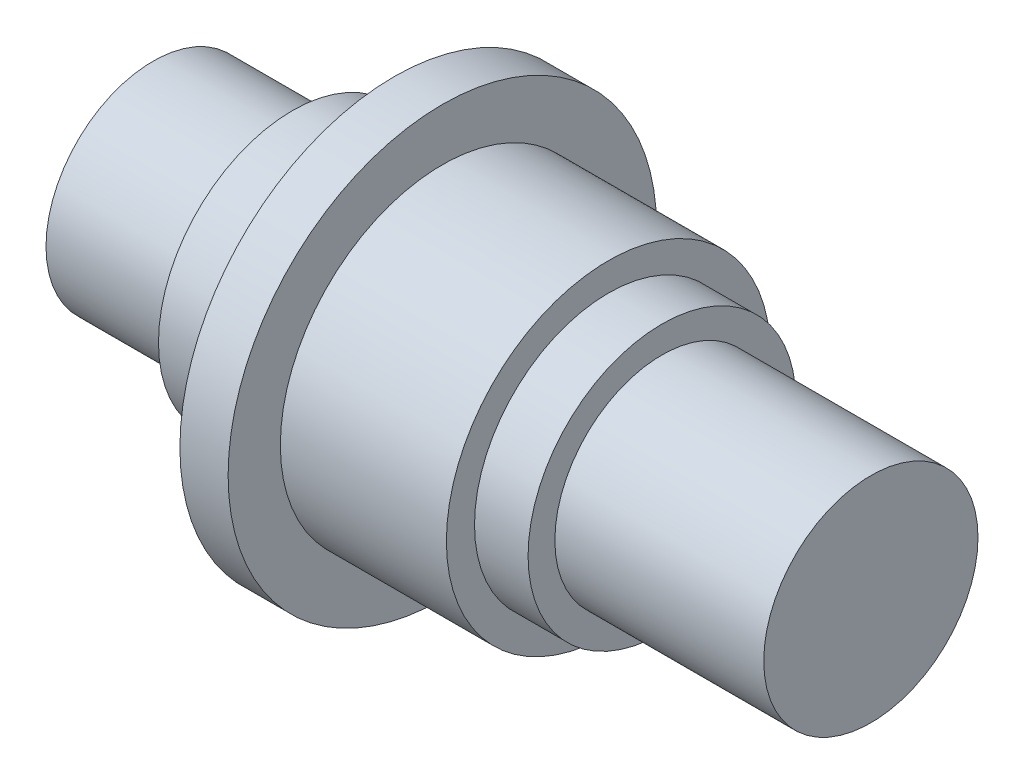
from build123d import *

# Parameters (mm, degrees)
RESSALTO_EXTRUS_O1_DEPTH      = 7.35
RESSALTO_EXTRUS_O1_DEPTH_BACK = 6.05
ESBO_O1_R                     = 2
ESBO_O3_R                     = 3.025
RESSALTO_EXTRUS_O3_DEPTH      = 1.6
ESBO_O2_R                     = 2.5
RESSALTO_EXTRUS_O2_DEPTH      = 3.45
RESSALTO_EXTRUS_O4_DEPTH      = 0.8
RESSALTO_EXTRUS_O4_DEPTH_BACK = 0.1
ESBO_O4_R                     = 4


with BuildPart() as part:
    # Esbo_o1 → Ressalto-extrus_o1 (new, two sides: drawn at the far end of the back side and taken through both)
    with BuildSketch(Plane(origin=(0, 0, 0), x_dir=(0, 0, -1), z_dir=(1, 0, 0)).offset(-RESSALTO_EXTRUS_O1_DEPTH_BACK)):
        Circle(ESBO_O1_R)
    extrude(amount=RESSALTO_EXTRUS_O1_DEPTH + RESSALTO_EXTRUS_O1_DEPTH_BACK)

    # Esbo_o3 → Ressalto-extrus_o3 (add, symmetric)
    with BuildSketch(Plane(origin=(0.85, 0, 0), x_dir=(0, 0, -1), z_dir=(1, 0, 0))):
        Circle(ESBO_O3_R)
    extrude(amount=RESSALTO_EXTRUS_O3_DEPTH, both=True)

    # Esbo_o2 → Ressalto-extrus_o2 (add, symmetric)
    with BuildSketch(Plane.ZY):
        with Locations(Location((0, 0, 0), (0, 0, 180))):
            Circle(ESBO_O2_R)
    ressalto_extrus_o2 = extrude(amount=RESSALTO_EXTRUS_O2_DEPTH, both=True)

    # Espelhar1: Ressalto-extrus_o2 across plane
    add(ressalto_extrus_o2.mirror(Plane(origin=(0, 0, 0), x_dir=(0, 0, 1), z_dir=(1, 0, 0))))

    # Esbo_o4 → Ressalto-extrus_o4 (add, two sides: drawn at the far end of the back side and taken through both)
    with BuildSketch(Plane.ZY.offset(0.75).offset(-RESSALTO_EXTRUS_O4_DEPTH_BACK)):
        Circle(ESBO_O4_R)
    extrude(amount=RESSALTO_EXTRUS_O4_DEPTH + RESSALTO_EXTRUS_O4_DEPTH_BACK)


solid = part.part
